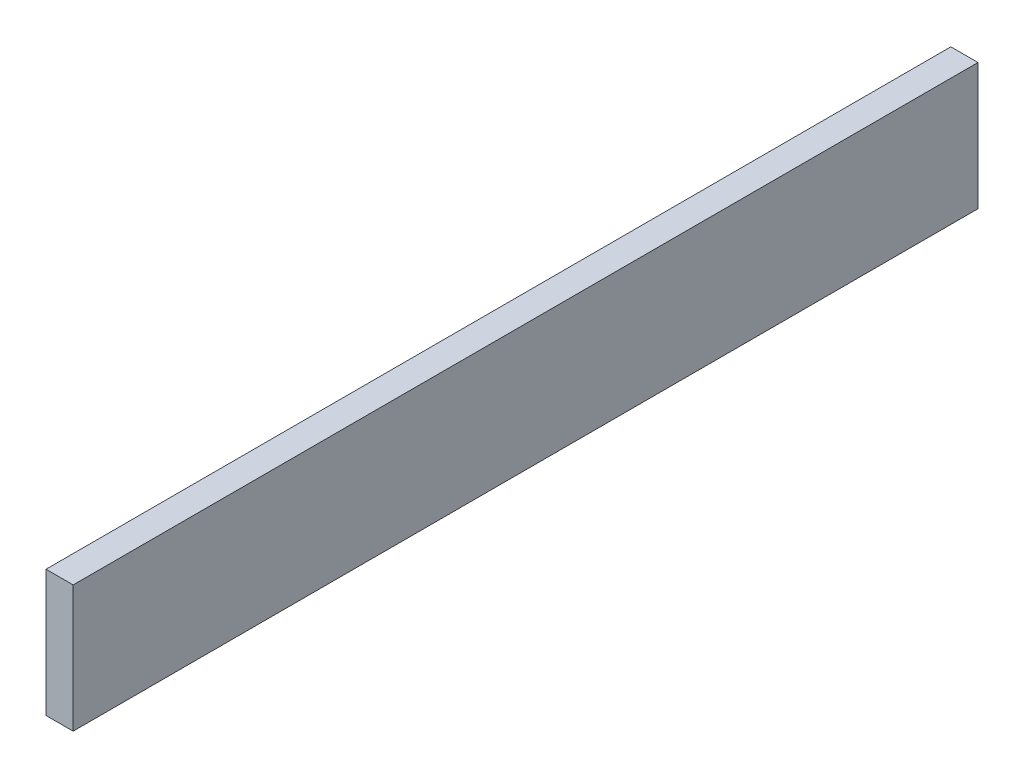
ISO-10303-21;
HEADER;
FILE_DESCRIPTION(('STEP AP214'),'2;1');
FILE_NAME('part.step','',(''),(''),'','','');
FILE_SCHEMA(('AUTOMOTIVE_DESIGN { 1 0 10303 214 1 1 1 1 }'));
ENDSEC;
DATA;
#1=APPLICATION_CONTEXT('core data for automotive mechanical design processes');
#2=APPLICATION_PROTOCOL_DEFINITION('international standard','automotive_design',2000,#1);
#3=PRODUCT_CONTEXT('',#1,'mechanical');
#4=PRODUCT('Part','Part','',(#3));
#5=PRODUCT_RELATED_PRODUCT_CATEGORY('part','',(#4));
#6=PRODUCT_DEFINITION_FORMATION('','',#4);
#7=PRODUCT_DEFINITION_CONTEXT('part definition',#1,'design');
#8=PRODUCT_DEFINITION('design','',#6,#7);
#9=PRODUCT_DEFINITION_SHAPE('','',#8);
#10=(LENGTH_UNIT() NAMED_UNIT(*) SI_UNIT(.MILLI.,.METRE.));
#11=(NAMED_UNIT(*) PLANE_ANGLE_UNIT() SI_UNIT($,.RADIAN.));
#12=(NAMED_UNIT(*) SI_UNIT($,.STERADIAN.) SOLID_ANGLE_UNIT());
#13=UNCERTAINTY_MEASURE_WITH_UNIT(LENGTH_MEASURE(1.E-05),#10,'distance_accuracy_value','');
#14=(GEOMETRIC_REPRESENTATION_CONTEXT(3) GLOBAL_UNCERTAINTY_ASSIGNED_CONTEXT((#13)) GLOBAL_UNIT_ASSIGNED_CONTEXT((#10,
#11,#12)) REPRESENTATION_CONTEXT('',''));
#15=CARTESIAN_POINT('',(0.,0.,0.));
#16=DIRECTION('',(0.,0.,1.));
#17=DIRECTION('',(1.,0.,0.));
#18=AXIS2_PLACEMENT_3D('',#15,#16,#17);
#19=CARTESIAN_POINT('',(9.525,0.,635.));
#20=DIRECTION('',(1.,0.,0.));
#21=DIRECTION('',(0.,1.,0.));
#22=AXIS2_PLACEMENT_3D('',#19,#20,#21);
#23=PLANE('',#22);
#24=DIRECTION('',(0.,-1.,0.));
#25=VECTOR('',#24,1.);
#26=CARTESIAN_POINT('',(9.525,0.,0.));
#27=LINE('',#26,#25);
#28=CARTESIAN_POINT('',(9.52499999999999,44.45,0.));
#29=VERTEX_POINT('',#28);
#30=CARTESIAN_POINT('',(9.525,-44.45,0.));
#31=VERTEX_POINT('',#30);
#32=EDGE_CURVE('E110',#29,#31,#27,.T.);
#33=ORIENTED_EDGE('',*,*,#32,.F.);
#34=DIRECTION('',(0.,0.,-1.));
#35=VECTOR('',#34,1.);
#36=CARTESIAN_POINT('',(9.52499999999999,44.45,635.));
#37=LINE('',#36,#35);
#38=CARTESIAN_POINT('',(9.52499999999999,44.45,635.));
#39=VERTEX_POINT('',#38);
#40=EDGE_CURVE('E11',#39,#29,#37,.T.);
#41=ORIENTED_EDGE('',*,*,#40,.F.);
#42=DIRECTION('',(0.,-1.,0.));
#43=VECTOR('',#42,1.);
#44=CARTESIAN_POINT('',(9.525,0.,635.));
#45=LINE('',#44,#43);
#46=CARTESIAN_POINT('',(9.525,-44.45,635.));
#47=VERTEX_POINT('',#46);
#48=EDGE_CURVE('E101',#39,#47,#45,.T.);
#49=ORIENTED_EDGE('',*,*,#48,.T.);
#50=DIRECTION('',(0.,0.,-1.));
#51=VECTOR('',#50,1.);
#52=CARTESIAN_POINT('',(9.525,-44.45,635.));
#53=LINE('',#52,#51);
#54=EDGE_CURVE('E80',#47,#31,#53,.T.);
#55=ORIENTED_EDGE('',*,*,#54,.T.);
#56=EDGE_LOOP('',(#33,#41,#49,#55));
#57=FACE_BOUND('',#56,.T.);
#58=ADVANCED_FACE('F41',(#57),#23,.T.);
#59=CARTESIAN_POINT('',(0.,44.45,635.));
#60=DIRECTION('',(0.,1.,0.));
#61=DIRECTION('',(0.,0.,1.));
#62=AXIS2_PLACEMENT_3D('',#59,#60,#61);
#63=PLANE('',#62);
#64=DIRECTION('',(1.,0.,0.));
#65=VECTOR('',#64,1.);
#66=CARTESIAN_POINT('',(0.,44.45,0.));
#67=LINE('',#66,#65);
#68=CARTESIAN_POINT('',(-9.52500000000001,44.45,0.));
#69=VERTEX_POINT('',#68);
#70=EDGE_CURVE('E93',#69,#29,#67,.T.);
#71=ORIENTED_EDGE('',*,*,#70,.F.);
#72=DIRECTION('',(0.,0.,-1.));
#73=VECTOR('',#72,1.);
#74=CARTESIAN_POINT('',(-9.52500000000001,44.45,635.));
#75=LINE('',#74,#73);
#76=CARTESIAN_POINT('',(-9.52500000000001,44.45,635.));
#77=VERTEX_POINT('',#76);
#78=EDGE_CURVE('E50',#77,#69,#75,.T.);
#79=ORIENTED_EDGE('',*,*,#78,.F.);
#80=DIRECTION('',(1.,0.,0.));
#81=VECTOR('',#80,1.);
#82=CARTESIAN_POINT('',(0.,44.45,635.));
#83=LINE('',#82,#81);
#84=EDGE_CURVE('E91',#77,#39,#83,.T.);
#85=ORIENTED_EDGE('',*,*,#84,.T.);
#86=ORIENTED_EDGE('',*,*,#40,.T.);
#87=EDGE_LOOP('',(#71,#79,#85,#86));
#88=FACE_BOUND('',#87,.T.);
#89=ADVANCED_FACE('F89',(#88),#63,.T.);
#90=CARTESIAN_POINT('',(-9.52499999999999,0.,635.));
#91=DIRECTION('',(1.,0.,0.));
#92=DIRECTION('',(0.,1.,0.));
#93=AXIS2_PLACEMENT_3D('',#90,#91,#92);
#94=PLANE('',#93);
#95=DIRECTION('',(0.,-1.,0.));
#96=VECTOR('',#95,1.);
#97=CARTESIAN_POINT('',(-9.52499999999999,0.,0.));
#98=LINE('',#97,#96);
#99=CARTESIAN_POINT('',(-9.52499999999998,-44.45,0.));
#100=VERTEX_POINT('',#99);
#101=EDGE_CURVE('E73',#69,#100,#98,.T.);
#102=ORIENTED_EDGE('',*,*,#101,.T.);
#103=DIRECTION('',(0.,0.,-1.));
#104=VECTOR('',#103,1.);
#105=CARTESIAN_POINT('',(-9.52499999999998,-44.45,635.));
#106=LINE('',#105,#104);
#107=CARTESIAN_POINT('',(-9.52499999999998,-44.45,635.));
#108=VERTEX_POINT('',#107);
#109=EDGE_CURVE('E95',#108,#100,#106,.T.);
#110=ORIENTED_EDGE('',*,*,#109,.F.);
#111=DIRECTION('',(0.,-1.,0.));
#112=VECTOR('',#111,1.);
#113=CARTESIAN_POINT('',(-9.52499999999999,0.,635.));
#114=LINE('',#113,#112);
#115=EDGE_CURVE('E96',#77,#108,#114,.T.);
#116=ORIENTED_EDGE('',*,*,#115,.F.);
#117=ORIENTED_EDGE('',*,*,#78,.T.);
#118=EDGE_LOOP('',(#102,#110,#116,#117));
#119=FACE_BOUND('',#118,.T.);
#120=ADVANCED_FACE('F97',(#119),#94,.F.);
#121=CARTESIAN_POINT('',(0.,-44.45,635.));
#122=DIRECTION('',(0.,1.,0.));
#123=DIRECTION('',(0.,0.,1.));
#124=AXIS2_PLACEMENT_3D('',#121,#122,#123);
#125=PLANE('',#124);
#126=DIRECTION('',(1.,0.,0.));
#127=VECTOR('',#126,1.);
#128=CARTESIAN_POINT('',(0.,-44.45,0.));
#129=LINE('',#128,#127);
#130=EDGE_CURVE('E105',#100,#31,#129,.T.);
#131=ORIENTED_EDGE('',*,*,#130,.T.);
#132=ORIENTED_EDGE('',*,*,#54,.F.);
#133=DIRECTION('',(1.,0.,0.));
#134=VECTOR('',#133,1.);
#135=CARTESIAN_POINT('',(0.,-44.45,635.));
#136=LINE('',#135,#134);
#137=EDGE_CURVE('E58',#108,#47,#136,.T.);
#138=ORIENTED_EDGE('',*,*,#137,.F.);
#139=ORIENTED_EDGE('',*,*,#109,.T.);
#140=EDGE_LOOP('',(#131,#132,#138,#139));
#141=FACE_BOUND('',#140,.T.);
#142=ADVANCED_FACE('F125',(#141),#125,.F.);
#143=CARTESIAN_POINT('',(0.,0.,635.));
#144=DIRECTION('',(0.,0.,1.));
#145=DIRECTION('',(1.,0.,0.));
#146=AXIS2_PLACEMENT_3D('',#143,#144,#145);
#147=PLANE('',#146);
#148=ORIENTED_EDGE('',*,*,#48,.F.);
#149=ORIENTED_EDGE('',*,*,#84,.F.);
#150=ORIENTED_EDGE('',*,*,#115,.T.);
#151=ORIENTED_EDGE('',*,*,#137,.T.);
#152=EDGE_LOOP('',(#148,#149,#150,#151));
#153=FACE_BOUND('',#152,.T.);
#154=ADVANCED_FACE('F100',(#153),#147,.T.);
#155=CARTESIAN_POINT('',(0.,0.,0.));
#156=DIRECTION('',(0.,0.,1.));
#157=DIRECTION('',(1.,0.,0.));
#158=AXIS2_PLACEMENT_3D('',#155,#156,#157);
#159=PLANE('',#158);
#160=ORIENTED_EDGE('',*,*,#32,.T.);
#161=ORIENTED_EDGE('',*,*,#130,.F.);
#162=ORIENTED_EDGE('',*,*,#101,.F.);
#163=ORIENTED_EDGE('',*,*,#70,.T.);
#164=EDGE_LOOP('',(#160,#161,#162,#163));
#165=FACE_BOUND('',#164,.T.);
#166=ADVANCED_FACE('F127',(#165),#159,.F.);
#167=CLOSED_SHELL('',(#58,#89,#120,#142,#154,#166));
#168=MANIFOLD_SOLID_BREP('B2',#167);
#169=ADVANCED_BREP_SHAPE_REPRESENTATION('',(#18,#168),#14);
#170=SHAPE_DEFINITION_REPRESENTATION(#9,#169);
ENDSEC;
END-ISO-10303-21;
